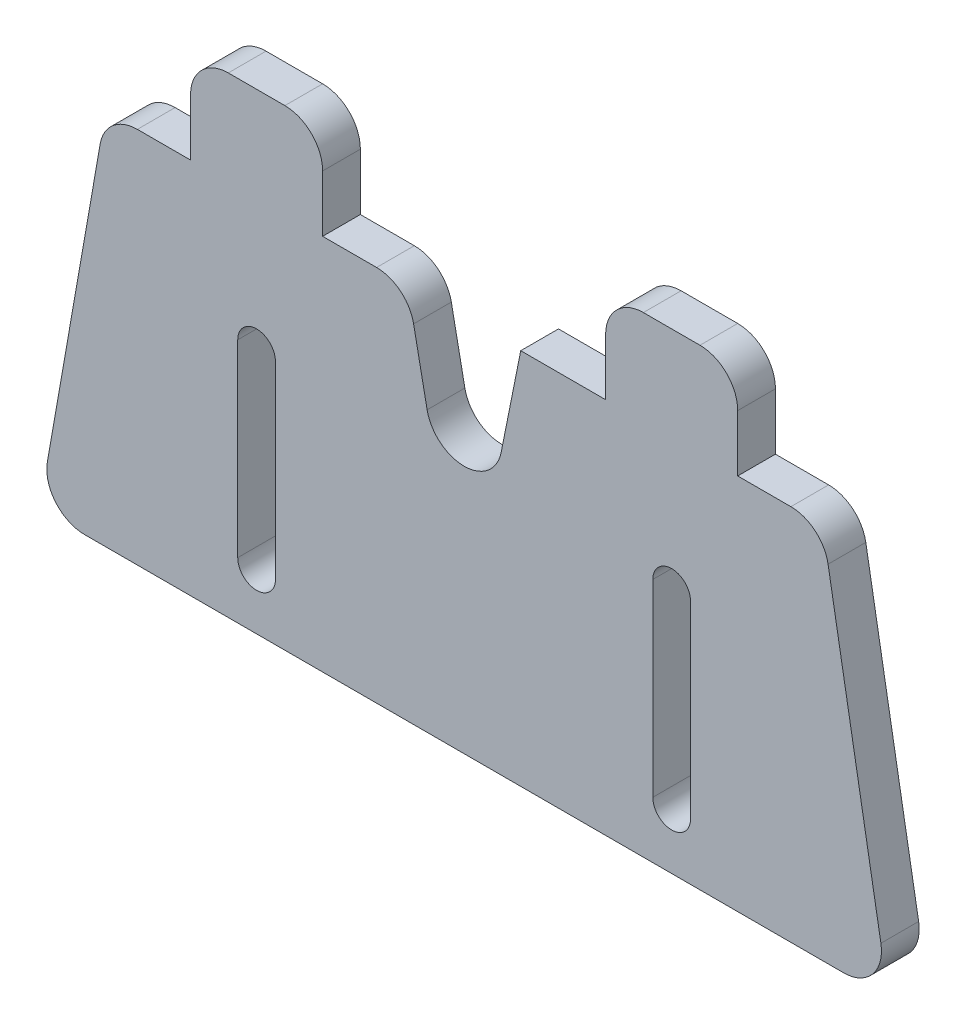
from build123d import *

# Parameters (mm, degrees)
RESSALTO_EXTRUS_O1_DEPTH = 2
FILETE1_R                = 2


with BuildPart() as part:
    # Esbo_o1 → Ressalto-extrus_o1 (new body)
    with BuildSketch(Plane.XY):
        Polygon((-7.5, 12.5), (-14.5, 12.5), (-14.5, 7.5), (-19, 7.5), (-22.5, -12.5), (22.5, -12.5), (19, 7.5), (14.5, 7.5), (14.5, 12.5), (7.5, 12.5), (7.5, 7.5), (3, 7.5), (0, -7.5), (-3, 7.5), (-7.5, 7.5), align=None)
        with BuildLine():
            ThreePointArc((-12, 0.5), (-11, 1.5), (-10, 0.5))
            Line((-10, 0.5), (-10, -9.5))
            ThreePointArc((-10, -9.5), (-11, -10.5), (-12, -9.5))
            Line((-12, -9.5), (-12, 0.5))
        make_face(mode=Mode.SUBTRACT)
        with BuildLine():
            Line((10, -9.5), (10, 0.5))
            ThreePointArc((10, 0.5), (11, 1.5), (12, 0.5))
            Line((12, 0.5), (12, -9.5))
            ThreePointArc((12, -9.5), (11, -10.5), (10, -9.5))
        make_face(mode=Mode.SUBTRACT)
    extrude(amount=RESSALTO_EXTRUS_O1_DEPTH)

    # Filete1
    filete1_edges = [part.edges().sort_by_distance(p)[0] for p in [
        (-22.5, -12.5, 1),
        (-19, 7.5, 1),
        (-14.5, 12.5, 1),
        (-7.5, 12.5, 1),
        (-3, 7.5, 1),
        (0, -7.5, 1),
        (7.5, 12.5, 1),
        (14.5, 12.5, 1),
        (19, 7.5, 1),
        (22.5, -12.5, 1),
    ]]
    fillet(filete1_edges, radius=FILETE1_R)


solid = part.part
